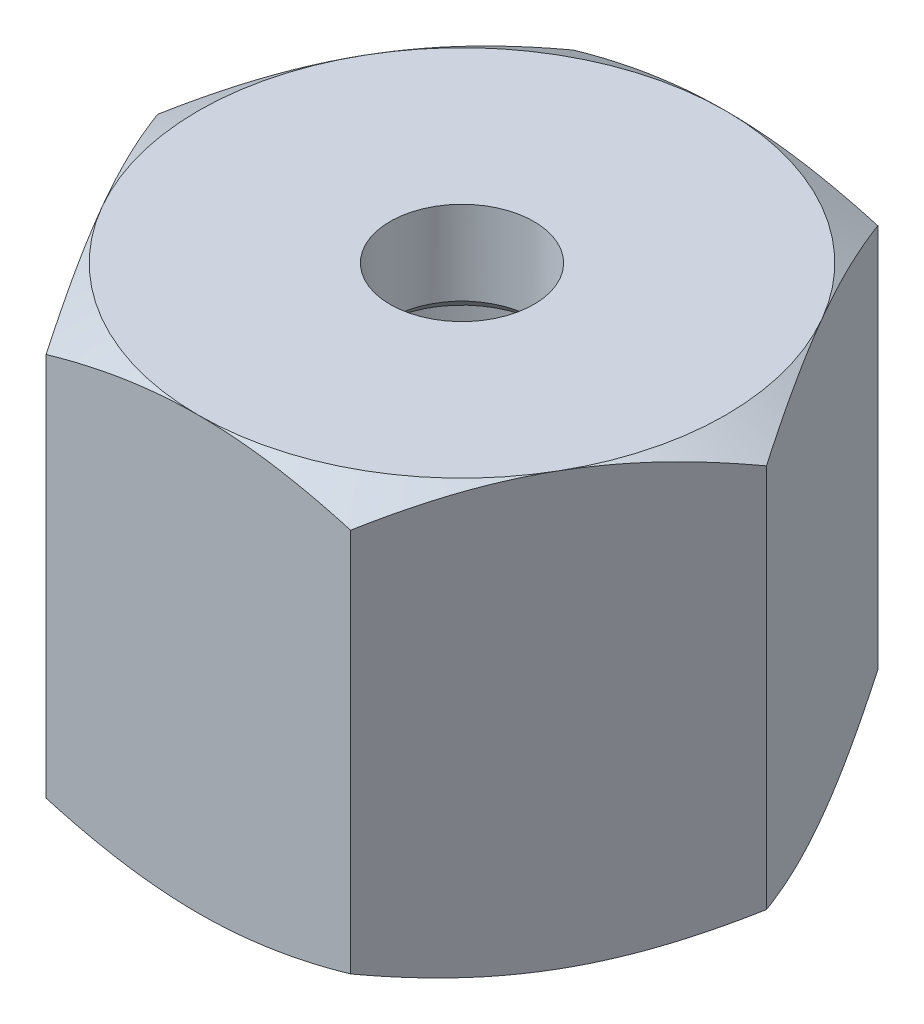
ISO-10303-21;
HEADER;
FILE_DESCRIPTION(('STEP AP214'),'2;1');
FILE_NAME('part.step','',(''),(''),'','','');
FILE_SCHEMA(('AUTOMOTIVE_DESIGN { 1 0 10303 214 1 1 1 1 }'));
ENDSEC;
DATA;
#1=APPLICATION_CONTEXT('core data for automotive mechanical design processes');
#2=APPLICATION_PROTOCOL_DEFINITION('international standard','automotive_design',2000,#1);
#3=PRODUCT_CONTEXT('',#1,'mechanical');
#4=PRODUCT('Part','Part','',(#3));
#5=PRODUCT_RELATED_PRODUCT_CATEGORY('part','',(#4));
#6=PRODUCT_DEFINITION_FORMATION('','',#4);
#7=PRODUCT_DEFINITION_CONTEXT('part definition',#1,'design');
#8=PRODUCT_DEFINITION('design','',#6,#7);
#9=PRODUCT_DEFINITION_SHAPE('','',#8);
#10=(LENGTH_UNIT() NAMED_UNIT(*) SI_UNIT(.MILLI.,.METRE.));
#11=(NAMED_UNIT(*) PLANE_ANGLE_UNIT() SI_UNIT($,.RADIAN.));
#12=(NAMED_UNIT(*) SI_UNIT($,.STERADIAN.) SOLID_ANGLE_UNIT());
#13=UNCERTAINTY_MEASURE_WITH_UNIT(LENGTH_MEASURE(1.E-05),#10,'distance_accuracy_value','');
#14=(GEOMETRIC_REPRESENTATION_CONTEXT(3) GLOBAL_UNCERTAINTY_ASSIGNED_CONTEXT((#13)) GLOBAL_UNIT_ASSIGNED_CONTEXT((#10,
#11,#12)) REPRESENTATION_CONTEXT('',''));
#15=CARTESIAN_POINT('',(0.,0.,0.));
#16=DIRECTION('',(0.,0.,1.));
#17=DIRECTION('',(1.,0.,0.));
#18=AXIS2_PLACEMENT_3D('',#15,#16,#17);
#19=CARTESIAN_POINT('',(6.35085296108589,18.,11.));
#20=DIRECTION('',(-0.866025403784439,0.,-0.5));
#21=DIRECTION('',(-0.5,0.,0.866025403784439));
#22=AXIS2_PLACEMENT_3D('',#19,#20,#21);
#23=PLANE('',#22);
#24=CARTESIAN_POINT('',(12.7018213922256,0.982547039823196,-0.000200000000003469));
#25=CARTESIAN_POINT('',(12.5622159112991,0.901959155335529,0.241603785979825));
#26=CARTESIAN_POINT('',(12.4220899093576,0.825028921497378,0.48430914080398));
#27=CARTESIAN_POINT('',(12.1407142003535,0.67949864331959,0.971666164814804));
#28=CARTESIAN_POINT('',(11.999464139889,0.610901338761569,1.21631844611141));
#29=CARTESIAN_POINT('',(11.5734380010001,0.418936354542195,1.9542173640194));
#30=CARTESIAN_POINT('',(11.2869801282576,0.309747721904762,2.45037695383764));
#31=CARTESIAN_POINT('',(10.8583090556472,0.181714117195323,3.19285703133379));
#32=CARTESIAN_POINT('',(10.7173765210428,0.145242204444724,3.43695934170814));
#33=CARTESIAN_POINT('',(10.4348589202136,0.0840813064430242,3.92629418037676));
#34=CARTESIAN_POINT('',(10.2932738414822,0.0593925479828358,4.17152673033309));
#35=CARTESIAN_POINT('',(10.0098676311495,0.0224303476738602,4.66240068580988));
#36=CARTESIAN_POINT('',(9.86804698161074,0.0101421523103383,4.90804125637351));
#37=CARTESIAN_POINT('',(9.58427426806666,-0.00175707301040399,5.39955001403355));
#38=CARTESIAN_POINT('',(9.44232220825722,-0.00136849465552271,5.64541819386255));
#39=CARTESIAN_POINT('',(9.17694200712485,0.0112011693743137,6.10507018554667));
#40=CARTESIAN_POINT('',(9.05349494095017,0.0218490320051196,6.31888677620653));
#41=CARTESIAN_POINT('',(8.80688473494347,0.0525316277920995,6.74602818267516));
#42=CARTESIAN_POINT('',(8.68372161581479,0.0725670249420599,6.9593529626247));
#43=CARTESIAN_POINT('',(8.43774623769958,0.12167538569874,7.38539481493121));
#44=CARTESIAN_POINT('',(8.31493435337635,0.150755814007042,7.59811123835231));
#45=CARTESIAN_POINT('',(8.0698863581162,0.217443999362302,8.02254681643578));
#46=CARTESIAN_POINT('',(7.94765028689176,0.255052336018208,8.23426590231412));
#47=CARTESIAN_POINT('',(7.5765957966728,0.38161991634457,8.87695113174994));
#48=CARTESIAN_POINT('',(7.32885191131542,0.483199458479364,9.30605612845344));
#49=CARTESIAN_POINT('',(6.83705838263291,0.713743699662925,10.1578675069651));
#50=CARTESIAN_POINT('',(6.59300244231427,0.842654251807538,10.580584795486));
#51=CARTESIAN_POINT('',(6.35073749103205,0.982547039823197,11.0002));
#52=B_SPLINE_CURVE_WITH_KNOTS('',3,(#24,#25,#26,#27,#28,#29,#30,#31,#32,#33,#34,#35,#36,#37,#38,
#39,#40,#41,#42,#43,#44,#45,#46,#47,#48,#49,#50,#51),.UNSPECIFIED.,.F.,.F.,(4,2,2,2,2,2,2,2,2,2,
2,2,2,4),(0.,0.871755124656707,1.74379610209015,3.49159027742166,4.34403665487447,
5.19649943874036,6.0479468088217,6.89936787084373,7.64056020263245,8.38180496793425,
9.12366309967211,9.86557166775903,11.3820155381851,12.8954827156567),.UNSPECIFIED.);
#53=CARTESIAN_POINT('',(12.7017059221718,0.982480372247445,0.));
#54=VERTEX_POINT('',#53);
#55=CARTESIAN_POINT('',(9.52627944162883,0.,5.5));
#56=VERTEX_POINT('',#55);
#57=EDGE_CURVE('E53',#54,#56,#52,.T.);
#58=ORIENTED_EDGE('',*,*,#57,.F.);
#59=DIRECTION('',(0.,-1.,0.));
#60=VECTOR('',#59,1.);
#61=CARTESIAN_POINT('',(12.7017059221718,18.,0.));
#62=LINE('',#61,#60);
#63=CARTESIAN_POINT('',(12.7017059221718,17.0175196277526,0.));
#64=VERTEX_POINT('',#63);
#65=EDGE_CURVE('E172',#64,#54,#62,.T.);
#66=ORIENTED_EDGE('',*,*,#65,.F.);
#67=CARTESIAN_POINT('',(6.35073749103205,17.0174529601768,11.0002));
#68=CARTESIAN_POINT('',(6.49034297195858,17.0980408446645,10.7583962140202));
#69=CARTESIAN_POINT('',(6.63046897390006,17.1749710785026,10.515690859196));
#70=CARTESIAN_POINT('',(6.91184468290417,17.3205013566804,10.0283338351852));
#71=CARTESIAN_POINT('',(7.05309474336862,17.3890986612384,9.78368155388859));
#72=CARTESIAN_POINT('',(7.47912088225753,17.5810636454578,9.04578263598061));
#73=CARTESIAN_POINT('',(7.76557875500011,17.6902522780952,8.54962304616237));
#74=CARTESIAN_POINT('',(8.19424982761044,17.8182858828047,7.80714296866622));
#75=CARTESIAN_POINT('',(8.33518236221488,17.8547577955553,7.56304065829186));
#76=CARTESIAN_POINT('',(8.61769996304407,17.915918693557,7.07370581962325));
#77=CARTESIAN_POINT('',(8.75928504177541,17.9406074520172,6.82847326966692));
#78=CARTESIAN_POINT('',(9.04269125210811,17.9775696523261,6.33759931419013));
#79=CARTESIAN_POINT('',(9.18451190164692,17.9898578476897,6.0919587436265));
#80=CARTESIAN_POINT('',(9.468284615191,18.0017570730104,5.60044998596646));
#81=CARTESIAN_POINT('',(9.61023667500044,18.0013684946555,5.35458180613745));
#82=CARTESIAN_POINT('',(9.87561687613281,17.9887988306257,4.89492981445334));
#83=CARTESIAN_POINT('',(9.99906394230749,17.9781509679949,4.68111322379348));
#84=CARTESIAN_POINT('',(10.2456741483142,17.9474683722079,4.25397181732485));
#85=CARTESIAN_POINT('',(10.3688372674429,17.9274329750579,4.04064703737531));
#86=CARTESIAN_POINT('',(10.6148126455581,17.8783246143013,3.6146051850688));
#87=CARTESIAN_POINT('',(10.7376245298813,17.849244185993,3.4018887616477));
#88=CARTESIAN_POINT('',(10.9826725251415,17.7825560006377,2.97745318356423));
#89=CARTESIAN_POINT('',(11.1049085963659,17.7449476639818,2.76573409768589));
#90=CARTESIAN_POINT('',(11.4759630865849,17.6183800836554,2.12304886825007));
#91=CARTESIAN_POINT('',(11.7237069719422,17.5168005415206,1.69394387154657));
#92=CARTESIAN_POINT('',(12.2155005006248,17.2862563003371,0.842132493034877));
#93=CARTESIAN_POINT('',(12.4595564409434,17.1573457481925,0.419415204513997));
#94=CARTESIAN_POINT('',(12.7018213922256,17.0174529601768,-0.000200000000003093));
#95=B_SPLINE_CURVE_WITH_KNOTS('',3,(#67,#68,#69,#70,#71,#72,#73,#74,#75,#76,#77,#78,#79,#80,#81,
#82,#83,#84,#85,#86,#87,#88,#89,#90,#91,#92,#93,#94),.UNSPECIFIED.,.F.,.F.,(4,2,2,2,2,2,2,2,2,2,
2,2,2,4),(0.,0.871755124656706,1.74379610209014,3.49159027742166,4.34403665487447,
5.19649943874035,6.0479468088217,6.89936787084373,7.64056020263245,8.38180496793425,
9.12366309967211,9.86557166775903,11.3820155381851,12.8954827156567),.UNSPECIFIED.);
#96=CARTESIAN_POINT('',(9.52627944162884,18.,5.5));
#97=VERTEX_POINT('',#96);
#98=EDGE_CURVE('E217',#97,#64,#95,.T.);
#99=ORIENTED_EDGE('',*,*,#98,.F.);
#100=CARTESIAN_POINT('',(6.35085296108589,17.0175196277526,11.));
#101=VERTEX_POINT('',#100);
#102=EDGE_CURVE('E163',#101,#97,#95,.T.);
#103=ORIENTED_EDGE('',*,*,#102,.F.);
#104=DIRECTION('',(0.,-1.,0.));
#105=VECTOR('',#104,1.);
#106=CARTESIAN_POINT('',(6.35085296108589,18.,11.));
#107=LINE('',#106,#105);
#108=CARTESIAN_POINT('',(6.35085296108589,0.982480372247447,11.));
#109=VERTEX_POINT('',#108);
#110=EDGE_CURVE('E158',#101,#109,#107,.T.);
#111=ORIENTED_EDGE('',*,*,#110,.T.);
#112=EDGE_CURVE('E150',#56,#109,#52,.T.);
#113=ORIENTED_EDGE('',*,*,#112,.F.);
#114=EDGE_LOOP('',(#58,#66,#99,#103,#111,#113));
#115=FACE_BOUND('',#114,.T.);
#116=ADVANCED_FACE('F38',(#115),#23,.F.);
#117=CARTESIAN_POINT('',(12.7017059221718,18.,0.));
#118=DIRECTION('',(-0.866025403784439,0.,0.5));
#119=DIRECTION('',(0.5,0.,0.866025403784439));
#120=AXIS2_PLACEMENT_3D('',#117,#118,#119);
#121=PLANE('',#120);
#122=CARTESIAN_POINT('',(6.35073749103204,0.982547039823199,-11.0002));
#123=CARTESIAN_POINT('',(6.49034297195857,0.901959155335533,-10.7583962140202));
#124=CARTESIAN_POINT('',(6.63046897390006,0.825028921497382,-10.515690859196));
#125=CARTESIAN_POINT('',(6.91184468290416,0.679498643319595,-10.0283338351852));
#126=CARTESIAN_POINT('',(7.05309474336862,0.610901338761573,-9.7836815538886));
#127=CARTESIAN_POINT('',(7.47912088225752,0.418936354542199,-9.04578263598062));
#128=CARTESIAN_POINT('',(7.7655787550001,0.309747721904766,-8.54962304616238));
#129=CARTESIAN_POINT('',(8.19424982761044,0.181714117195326,-7.80714296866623));
#130=CARTESIAN_POINT('',(8.33518236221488,0.145242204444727,-7.56304065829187));
#131=CARTESIAN_POINT('',(8.61769996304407,0.0840813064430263,-7.07370581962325));
#132=CARTESIAN_POINT('',(8.75928504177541,0.0593925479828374,-6.82847326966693));
#133=CARTESIAN_POINT('',(9.04269125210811,0.0224303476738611,-6.33759931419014));
#134=CARTESIAN_POINT('',(9.18451190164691,0.0101421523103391,-6.09195874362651));
#135=CARTESIAN_POINT('',(9.468284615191,-0.00175707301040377,-5.60044998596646));
#136=CARTESIAN_POINT('',(9.61023667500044,-0.00136849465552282,-5.35458180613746));
#137=CARTESIAN_POINT('',(9.87561687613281,0.0112011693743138,-4.89492981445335));
#138=CARTESIAN_POINT('',(9.99906394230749,0.0218490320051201,-4.68111322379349));
#139=CARTESIAN_POINT('',(10.2456741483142,0.0525316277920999,-4.25397181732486));
#140=CARTESIAN_POINT('',(10.3688372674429,0.0725670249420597,-4.04064703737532));
#141=CARTESIAN_POINT('',(10.6148126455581,0.121675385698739,-3.61460518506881));
#142=CARTESIAN_POINT('',(10.7376245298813,0.150755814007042,-3.40188876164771));
#143=CARTESIAN_POINT('',(10.9826725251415,0.217443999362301,-2.97745318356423));
#144=CARTESIAN_POINT('',(11.1049085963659,0.255052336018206,-2.7657340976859));
#145=CARTESIAN_POINT('',(11.4759630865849,0.381619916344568,-2.12304886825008));
#146=CARTESIAN_POINT('',(11.7237069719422,0.483199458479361,-1.69394387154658));
#147=CARTESIAN_POINT('',(12.2155005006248,0.713743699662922,-0.842132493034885));
#148=CARTESIAN_POINT('',(12.4595564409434,0.842654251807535,-0.419415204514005));
#149=CARTESIAN_POINT('',(12.7018213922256,0.982547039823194,0.000199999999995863));
#150=B_SPLINE_CURVE_WITH_KNOTS('',3,(#122,#123,#124,#125,#126,#127,#128,#129,#130,#131,#132,
#133,#134,#135,#136,#137,#138,#139,#140,#141,#142,#143,#144,#145,#146,#147,#148,#149),
.UNSPECIFIED.,.F.,.F.,(4,2,2,2,2,2,2,2,2,2,2,2,2,4),(0.,0.871755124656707,1.74379610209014,
3.49159027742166,4.34403665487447,5.19649943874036,6.0479468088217,6.89936787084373,
7.64056020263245,8.38180496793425,9.12366309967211,9.86557166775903,11.3820155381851,
12.8954827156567),.UNSPECIFIED.);
#151=CARTESIAN_POINT('',(6.35085296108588,0.982480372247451,-11.));
#152=VERTEX_POINT('',#151);
#153=CARTESIAN_POINT('',(9.52627944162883,0.,-5.5));
#154=VERTEX_POINT('',#153);
#155=EDGE_CURVE('E61',#152,#154,#150,.T.);
#156=ORIENTED_EDGE('',*,*,#155,.F.);
#157=DIRECTION('',(0.,-1.,0.));
#158=VECTOR('',#157,1.);
#159=CARTESIAN_POINT('',(6.35085296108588,18.,-11.));
#160=LINE('',#159,#158);
#161=CARTESIAN_POINT('',(6.35085296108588,17.0175196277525,-11.));
#162=VERTEX_POINT('',#161);
#163=EDGE_CURVE('E169',#162,#152,#160,.T.);
#164=ORIENTED_EDGE('',*,*,#163,.F.);
#165=CARTESIAN_POINT('',(12.7018213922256,17.0174529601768,0.000199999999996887));
#166=CARTESIAN_POINT('',(12.5622159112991,17.0980408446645,-0.241603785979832));
#167=CARTESIAN_POINT('',(12.4220899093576,17.1749710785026,-0.484309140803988));
#168=CARTESIAN_POINT('',(12.1407142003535,17.3205013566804,-0.971666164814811));
#169=CARTESIAN_POINT('',(11.999464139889,17.3890986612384,-1.21631844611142));
#170=CARTESIAN_POINT('',(11.5734380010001,17.5810636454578,-1.9542173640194));
#171=CARTESIAN_POINT('',(11.2869801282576,17.6902522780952,-2.45037695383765));
#172=CARTESIAN_POINT('',(10.8583090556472,17.8182858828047,-3.1928570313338));
#173=CARTESIAN_POINT('',(10.7173765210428,17.8547577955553,-3.43695934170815));
#174=CARTESIAN_POINT('',(10.4348589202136,17.915918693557,-3.92629418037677));
#175=CARTESIAN_POINT('',(10.2932738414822,17.9406074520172,-4.17152673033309));
#176=CARTESIAN_POINT('',(10.0098676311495,17.9775696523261,-4.66240068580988));
#177=CARTESIAN_POINT('',(9.86804698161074,17.9898578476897,-4.90804125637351));
#178=CARTESIAN_POINT('',(9.58427426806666,18.0017570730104,-5.39955001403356));
#179=CARTESIAN_POINT('',(9.44232220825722,18.0013684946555,-5.64541819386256));
#180=CARTESIAN_POINT('',(9.17694200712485,17.9887988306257,-6.10507018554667));
#181=CARTESIAN_POINT('',(9.05349494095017,17.9781509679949,-6.31888677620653));
#182=CARTESIAN_POINT('',(8.80688473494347,17.9474683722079,-6.74602818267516));
#183=CARTESIAN_POINT('',(8.68372161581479,17.9274329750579,-6.9593529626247));
#184=CARTESIAN_POINT('',(8.43774623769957,17.8783246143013,-7.38539481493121));
#185=CARTESIAN_POINT('',(8.31493435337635,17.849244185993,-7.59811123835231));
#186=CARTESIAN_POINT('',(8.0698863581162,17.7825560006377,-8.02254681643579));
#187=CARTESIAN_POINT('',(7.94765028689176,17.7449476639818,-8.23426590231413));
#188=CARTESIAN_POINT('',(7.57659579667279,17.6183800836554,-8.87695113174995));
#189=CARTESIAN_POINT('',(7.32885191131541,17.5168005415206,-9.30605612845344));
#190=CARTESIAN_POINT('',(6.8370583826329,17.2862563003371,-10.1578675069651));
#191=CARTESIAN_POINT('',(6.59300244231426,17.1573457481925,-10.580584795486));
#192=CARTESIAN_POINT('',(6.35073749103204,17.0174529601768,-11.0002));
#193=B_SPLINE_CURVE_WITH_KNOTS('',3,(#165,#166,#167,#168,#169,#170,#171,#172,#173,#174,#175,
#176,#177,#178,#179,#180,#181,#182,#183,#184,#185,#186,#187,#188,#189,#190,#191,#192),
.UNSPECIFIED.,.F.,.F.,(4,2,2,2,2,2,2,2,2,2,2,2,2,4),(0.,0.871755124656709,1.74379610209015,
3.49159027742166,4.34403665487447,5.19649943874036,6.0479468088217,6.89936787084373,
7.64056020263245,8.38180496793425,9.12366309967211,9.86557166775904,11.3820155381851,
12.8954827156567),.UNSPECIFIED.);
#194=CARTESIAN_POINT('',(9.52627944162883,18.,-5.50000000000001));
#195=VERTEX_POINT('',#194);
#196=EDGE_CURVE('E294',#195,#162,#193,.T.);
#197=ORIENTED_EDGE('',*,*,#196,.F.);
#198=EDGE_CURVE('E298',#64,#195,#193,.T.);
#199=ORIENTED_EDGE('',*,*,#198,.F.);
#200=ORIENTED_EDGE('',*,*,#65,.T.);
#201=EDGE_CURVE('E262',#154,#54,#150,.T.);
#202=ORIENTED_EDGE('',*,*,#201,.F.);
#203=EDGE_LOOP('',(#156,#164,#197,#199,#200,#202));
#204=FACE_BOUND('',#203,.T.);
#205=ADVANCED_FACE('F204',(#204),#121,.F.);
#206=CARTESIAN_POINT('',(6.35085296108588,18.,-11.));
#207=DIRECTION('',(0.,0.,1.));
#208=DIRECTION('',(1.,0.,0.));
#209=AXIS2_PLACEMENT_3D('',#206,#207,#208);
#210=PLANE('',#209);
#211=CARTESIAN_POINT('',(-16.8458280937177,5.26496849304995,-11.));
#212=CARTESIAN_POINT('',(-16.60434649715,5.14823483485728,-11.));
#213=CARTESIAN_POINT('',(-16.3625730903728,5.03210512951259,-11.));
#214=CARTESIAN_POINT('',(-15.8783810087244,4.80119224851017,-11.));
#215=CARTESIAN_POINT('',(-15.6359623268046,4.68640908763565,-11.));
#216=CARTESIAN_POINT('',(-14.9075749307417,4.34425411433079,-11.));
#217=CARTESIAN_POINT('',(-14.4205533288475,4.119114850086,-11.));
#218=CARTESIAN_POINT('',(-13.4403598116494,3.67495503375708,-11.));
#219=CARTESIAN_POINT('',(-12.9471686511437,3.4559768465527,-11.));
#220=CARTESIAN_POINT('',(-11.9567341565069,3.02741887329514,-11.));
#221=CARTESIAN_POINT('',(-11.459491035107,2.81783859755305,-11.));
#222=CARTESIAN_POINT('',(-10.4539778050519,2.40808867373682,-11.));
#223=CARTESIAN_POINT('',(-9.94564729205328,2.208066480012,-11.));
#224=CARTESIAN_POINT('',(-8.92298777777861,1.82368101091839,-11.));
#225=CARTESIAN_POINT('',(-8.40865811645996,1.63931947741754,-11.));
#226=CARTESIAN_POINT('',(-7.37425454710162,1.29120979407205,-11.));
#227=CARTESIAN_POINT('',(-6.85419550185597,1.12741784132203,-11.));
#228=CARTESIAN_POINT('',(-5.80663388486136,0.825757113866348,-11.));
#229=CARTESIAN_POINT('',(-5.27913372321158,0.687880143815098,-11.));
#230=CARTESIAN_POINT('',(-4.48220250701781,0.505547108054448,-11.));
#231=CARTESIAN_POINT('',(-4.21555592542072,0.448840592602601,-11.));
#232=CARTESIAN_POINT('',(-3.68048740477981,0.34448343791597,-11.));
#233=CARTESIAN_POINT('',(-3.41206550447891,0.296832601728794,-11.));
#234=CARTESIAN_POINT('',(-2.87362104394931,0.211430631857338,-11.));
#235=CARTESIAN_POINT('',(-2.60359835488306,0.173680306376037,-11.));
#236=CARTESIAN_POINT('',(-2.06227809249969,0.108840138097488,-11.));
#237=CARTESIAN_POINT('',(-1.7909805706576,0.0817498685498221,-11.));
#238=CARTESIAN_POINT('',(-1.24921360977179,0.0389565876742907,-11.));
#239=CARTESIAN_POINT('',(-0.978749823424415,0.0231824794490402,-11.));
#240=CARTESIAN_POINT('',(-0.43739753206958,0.00310533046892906,-11.));
#241=CARTESIAN_POINT('',(-0.166509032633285,-0.00119785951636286,-11.));
#242=CARTESIAN_POINT('',(0.375129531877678,0.00176893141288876,-11.));
#243=CARTESIAN_POINT('',(0.645879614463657,0.00903566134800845,-11.));
#244=CARTESIAN_POINT('',(1.18683741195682,0.0349616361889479,-11.));
#245=CARTESIAN_POINT('',(1.45704509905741,0.0536214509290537,-11.));
#246=CARTESIAN_POINT('',(2.11186732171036,0.112257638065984,-11.));
#247=CARTESIAN_POINT('',(2.49597946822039,0.157937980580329,-11.));
#248=CARTESIAN_POINT('',(3.2612619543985,0.269786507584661,-11.));
#249=CARTESIAN_POINT('',(3.64243146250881,0.33596028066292,-11.));
#250=CARTESIAN_POINT('',(4.40151370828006,0.48644872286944,-11.));
#251=CARTESIAN_POINT('',(4.77942301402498,0.570780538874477,-11.));
#252=CARTESIAN_POINT('',(5.53135425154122,0.755011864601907,-11.));
#253=CARTESIAN_POINT('',(5.90537654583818,0.854909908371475,-11.));
#254=CARTESIAN_POINT('',(6.65874919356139,1.0704958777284,-11.));
#255=CARTESIAN_POINT('',(7.03800528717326,1.18651093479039,-11.));
#256=CARTESIAN_POINT('',(7.7925087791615,1.430009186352,-11.));
#257=CARTESIAN_POINT('',(8.16775874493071,1.55748447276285,-11.));
#258=CARTESIAN_POINT('',(8.91274428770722,1.82126962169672,-11.));
#259=CARTESIAN_POINT('',(9.28249901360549,1.95752572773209,-11.));
#260=CARTESIAN_POINT('',(10.0191392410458,2.23803873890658,-11.));
#261=CARTESIAN_POINT('',(10.3860235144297,2.3822988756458,-11.));
#262=CARTESIAN_POINT('',(10.7515747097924,2.52976936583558,-11.));
#263=B_SPLINE_CURVE_WITH_KNOTS('',3,(#211,#212,#213,#214,#215,#216,#217,#218,#219,#220,#221,
#222,#223,#224,#225,#226,#227,#228,#229,#230,#231,#232,#233,#234,#235,#236,#237,#238,#239,#240,
#241,#242,#243,#244,#245,#246,#247,#248,#249,#250,#251,#252,#253,#254,#255,#256,#257,#258,#259,
#260,#261,#262),.UNSPECIFIED.,.F.,.F.,(4,2,2,2,2,2,2,2,2,2,2,2,2,2,2,2,2,2,2,2,2,2,2,2,2,4),(0.,
0.804648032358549,1.60930489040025,3.21888018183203,4.83766217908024,6.45635972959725,
8.09496684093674,9.73375596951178,11.368993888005,13.0037138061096,13.8214137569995,
14.6390959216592,15.4568448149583,16.274560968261,17.0870934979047,17.8996154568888,
18.7119091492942,19.5242434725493,20.6840538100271,21.8441807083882,23.0054079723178,
24.1665259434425,25.3561172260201,26.5448938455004,27.7269802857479,28.9095475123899),.UNSPECIFIED.);
#264=CARTESIAN_POINT('',(-6.35085296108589,0.982480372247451,-11.));
#265=VERTEX_POINT('',#264);
#266=CARTESIAN_POINT('',(0.,0.,-11.));
#267=VERTEX_POINT('',#266);
#268=EDGE_CURVE('E271',#265,#267,#263,.T.);
#269=ORIENTED_EDGE('',*,*,#268,.F.);
#270=DIRECTION('',(0.,-1.,0.));
#271=VECTOR('',#270,1.);
#272=CARTESIAN_POINT('',(-6.35085296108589,18.,-11.));
#273=LINE('',#272,#271);
#274=CARTESIAN_POINT('',(-6.35085296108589,17.0175196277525,-11.));
#275=VERTEX_POINT('',#274);
#276=EDGE_CURVE('E160',#275,#265,#273,.T.);
#277=ORIENTED_EDGE('',*,*,#276,.F.);
#278=CARTESIAN_POINT('',(-16.8458280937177,12.7350315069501,-11.));
#279=CARTESIAN_POINT('',(-16.60434649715,12.8517651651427,-11.));
#280=CARTESIAN_POINT('',(-16.3625730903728,12.9678948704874,-11.));
#281=CARTESIAN_POINT('',(-15.8783810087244,13.1988077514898,-11.));
#282=CARTESIAN_POINT('',(-15.6359623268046,13.3135909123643,-11.));
#283=CARTESIAN_POINT('',(-14.9075749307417,13.6557458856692,-11.));
#284=CARTESIAN_POINT('',(-14.4205533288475,13.880885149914,-11.));
#285=CARTESIAN_POINT('',(-13.4403598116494,14.3250449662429,-11.));
#286=CARTESIAN_POINT('',(-12.9471686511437,14.5440231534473,-11.));
#287=CARTESIAN_POINT('',(-11.9567341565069,14.9725811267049,-11.));
#288=CARTESIAN_POINT('',(-11.459491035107,15.182161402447,-11.));
#289=CARTESIAN_POINT('',(-10.4539778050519,15.5919113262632,-11.));
#290=CARTESIAN_POINT('',(-9.94564729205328,15.791933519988,-11.));
#291=CARTESIAN_POINT('',(-8.92298777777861,16.1763189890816,-11.));
#292=CARTESIAN_POINT('',(-8.40865811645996,16.3606805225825,-11.));
#293=CARTESIAN_POINT('',(-7.37425454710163,16.708790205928,-11.));
#294=CARTESIAN_POINT('',(-6.85419550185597,16.872582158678,-11.));
#295=CARTESIAN_POINT('',(-5.80663388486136,17.1742428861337,-11.));
#296=CARTESIAN_POINT('',(-5.27913372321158,17.3121198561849,-11.));
#297=CARTESIAN_POINT('',(-4.48220250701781,17.4944528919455,-11.));
#298=CARTESIAN_POINT('',(-4.21555592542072,17.5511594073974,-11.));
#299=CARTESIAN_POINT('',(-3.68048740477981,17.655516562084,-11.));
#300=CARTESIAN_POINT('',(-3.41206550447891,17.7031673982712,-11.));
#301=CARTESIAN_POINT('',(-2.87362104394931,17.7885693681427,-11.));
#302=CARTESIAN_POINT('',(-2.60359835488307,17.826319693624,-11.));
#303=CARTESIAN_POINT('',(-2.06227809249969,17.8911598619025,-11.));
#304=CARTESIAN_POINT('',(-1.7909805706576,17.9182501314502,-11.));
#305=CARTESIAN_POINT('',(-1.24921360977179,17.9610434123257,-11.));
#306=CARTESIAN_POINT('',(-0.978749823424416,17.976817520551,-11.));
#307=CARTESIAN_POINT('',(-0.437397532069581,17.9968946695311,-11.));
#308=CARTESIAN_POINT('',(-0.166509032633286,18.0011978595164,-11.));
#309=CARTESIAN_POINT('',(0.375129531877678,17.9982310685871,-11.));
#310=CARTESIAN_POINT('',(0.645879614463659,17.990964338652,-11.));
#311=CARTESIAN_POINT('',(1.18683741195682,17.9650383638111,-11.));
#312=CARTESIAN_POINT('',(1.45704509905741,17.9463785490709,-11.));
#313=CARTESIAN_POINT('',(2.11186732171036,17.887742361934,-11.));
#314=CARTESIAN_POINT('',(2.49597946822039,17.8420620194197,-11.));
#315=CARTESIAN_POINT('',(3.26126195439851,17.7302134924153,-11.));
#316=CARTESIAN_POINT('',(3.64243146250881,17.6640397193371,-11.));
#317=CARTESIAN_POINT('',(4.40151370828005,17.5135512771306,-11.));
#318=CARTESIAN_POINT('',(4.77942301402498,17.4292194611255,-11.));
#319=CARTESIAN_POINT('',(5.53135425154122,17.2449881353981,-11.));
#320=CARTESIAN_POINT('',(5.90537654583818,17.1450900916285,-11.));
#321=CARTESIAN_POINT('',(6.65874919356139,16.9295041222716,-11.));
#322=CARTESIAN_POINT('',(7.03800528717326,16.8134890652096,-11.));
#323=CARTESIAN_POINT('',(7.7925087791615,16.569990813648,-11.));
#324=CARTESIAN_POINT('',(8.1677587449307,16.4425155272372,-11.));
#325=CARTESIAN_POINT('',(8.91274428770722,16.1787303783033,-11.));
#326=CARTESIAN_POINT('',(9.28249901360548,16.0424742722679,-11.));
#327=CARTESIAN_POINT('',(10.0191392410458,15.7619612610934,-11.));
#328=CARTESIAN_POINT('',(10.3860235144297,15.6177011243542,-11.));
#329=CARTESIAN_POINT('',(10.7515747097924,15.4702306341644,-11.));
#330=B_SPLINE_CURVE_WITH_KNOTS('',3,(#278,#279,#280,#281,#282,#283,#284,#285,#286,#287,#288,
#289,#290,#291,#292,#293,#294,#295,#296,#297,#298,#299,#300,#301,#302,#303,#304,#305,#306,#307,
#308,#309,#310,#311,#312,#313,#314,#315,#316,#317,#318,#319,#320,#321,#322,#323,#324,#325,#326,
#327,#328,#329),.UNSPECIFIED.,.F.,.F.,(4,2,2,2,2,2,2,2,2,2,2,2,2,2,2,2,2,2,2,2,2,2,2,2,2,4),(0.,
0.804648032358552,1.60930489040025,3.21888018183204,4.83766217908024,6.45635972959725,
8.09496684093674,9.73375596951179,11.368993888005,13.0037138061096,13.8214137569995,
14.6390959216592,15.4568448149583,16.2745609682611,17.0870934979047,17.8996154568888,
18.7119091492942,19.5242434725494,20.6840538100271,21.8441807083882,23.0054079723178,
24.1665259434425,25.3561172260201,26.5448938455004,27.726980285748,28.9095475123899),.UNSPECIFIED.);
#331=CARTESIAN_POINT('',(0.,18.,-11.));
#332=VERTEX_POINT('',#331);
#333=EDGE_CURVE('E282',#332,#275,#330,.F.);
#334=ORIENTED_EDGE('',*,*,#333,.F.);
#335=EDGE_CURVE('E287',#162,#332,#330,.F.);
#336=ORIENTED_EDGE('',*,*,#335,.F.);
#337=ORIENTED_EDGE('',*,*,#163,.T.);
#338=EDGE_CURVE('E266',#267,#152,#263,.T.);
#339=ORIENTED_EDGE('',*,*,#338,.F.);
#340=EDGE_LOOP('',(#269,#277,#334,#336,#337,#339));
#341=FACE_BOUND('',#340,.T.);
#342=ADVANCED_FACE('F210',(#341),#210,.F.);
#343=CARTESIAN_POINT('',(-6.35085296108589,18.,-11.));
#344=DIRECTION('',(0.866025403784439,0.,0.5));
#345=DIRECTION('',(0.5,0.,-0.866025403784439));
#346=AXIS2_PLACEMENT_3D('',#343,#344,#345);
#347=PLANE('',#346);
#348=CARTESIAN_POINT('',(-12.7018213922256,0.982547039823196,0.000200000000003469));
#349=CARTESIAN_POINT('',(-12.5622159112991,0.90195915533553,-0.241603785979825));
#350=CARTESIAN_POINT('',(-12.4220899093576,0.825028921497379,-0.48430914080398));
#351=CARTESIAN_POINT('',(-12.1407142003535,0.679498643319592,-0.971666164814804));
#352=CARTESIAN_POINT('',(-11.999464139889,0.610901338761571,-1.21631844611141));
#353=CARTESIAN_POINT('',(-11.5734380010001,0.418936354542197,-1.9542173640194));
#354=CARTESIAN_POINT('',(-11.2869801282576,0.309747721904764,-2.45037695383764));
#355=CARTESIAN_POINT('',(-10.8583090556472,0.181714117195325,-3.19285703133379));
#356=CARTESIAN_POINT('',(-10.7173765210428,0.145242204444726,-3.43695934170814));
#357=CARTESIAN_POINT('',(-10.4348589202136,0.0840813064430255,-3.92629418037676));
#358=CARTESIAN_POINT('',(-10.2932738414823,0.0593925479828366,-4.17152673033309));
#359=CARTESIAN_POINT('',(-10.0098676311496,0.0224303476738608,-4.66240068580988));
#360=CARTESIAN_POINT('',(-9.86804698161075,0.0101421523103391,-4.90804125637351));
#361=CARTESIAN_POINT('',(-9.58427426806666,-0.00175707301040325,-5.39955001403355));
#362=CARTESIAN_POINT('',(-9.44232220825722,-0.00136849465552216,-5.64541819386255));
#363=CARTESIAN_POINT('',(-9.17694200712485,0.0112011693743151,-6.10507018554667));
#364=CARTESIAN_POINT('',(-9.05349494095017,0.0218490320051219,-6.31888677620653));
#365=CARTESIAN_POINT('',(-8.80688473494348,0.0525316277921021,-6.74602818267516));
#366=CARTESIAN_POINT('',(-8.68372161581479,0.072567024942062,-6.95935296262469));
#367=CARTESIAN_POINT('',(-8.43774623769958,0.121675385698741,-7.38539481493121));
#368=CARTESIAN_POINT('',(-8.31493435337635,0.150755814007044,-7.59811123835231));
#369=CARTESIAN_POINT('',(-8.06988635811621,0.217443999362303,-8.02254681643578));
#370=CARTESIAN_POINT('',(-7.94765028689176,0.255052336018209,-8.23426590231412));
#371=CARTESIAN_POINT('',(-7.5765957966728,0.381619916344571,-8.87695113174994));
#372=CARTESIAN_POINT('',(-7.32885191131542,0.483199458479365,-9.30605612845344));
#373=CARTESIAN_POINT('',(-6.83705838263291,0.713743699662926,-10.1578675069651));
#374=CARTESIAN_POINT('',(-6.59300244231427,0.84265425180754,-10.580584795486));
#375=CARTESIAN_POINT('',(-6.35073749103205,0.982547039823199,-11.0002));
#376=B_SPLINE_CURVE_WITH_KNOTS('',3,(#348,#349,#350,#351,#352,#353,#354,#355,#356,#357,#358,
#359,#360,#361,#362,#363,#364,#365,#366,#367,#368,#369,#370,#371,#372,#373,#374,#375),
.UNSPECIFIED.,.F.,.F.,(4,2,2,2,2,2,2,2,2,2,2,2,2,4),(0.,0.871755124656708,1.74379610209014,
3.49159027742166,4.34403665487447,5.19649943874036,6.0479468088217,6.89936787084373,
7.64056020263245,8.38180496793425,9.12366309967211,9.86557166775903,11.3820155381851,
12.8954827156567),.UNSPECIFIED.);
#377=CARTESIAN_POINT('',(-12.7017059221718,0.982480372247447,0.));
#378=VERTEX_POINT('',#377);
#379=CARTESIAN_POINT('',(-9.52627944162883,0.,-5.5));
#380=VERTEX_POINT('',#379);
#381=EDGE_CURVE('E233',#378,#380,#376,.T.);
#382=ORIENTED_EDGE('',*,*,#381,.F.);
#383=DIRECTION('',(0.,-1.,0.));
#384=VECTOR('',#383,1.);
#385=CARTESIAN_POINT('',(-12.7017059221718,18.,0.));
#386=LINE('',#385,#384);
#387=CARTESIAN_POINT('',(-12.7017059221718,17.0175196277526,0.));
#388=VERTEX_POINT('',#387);
#389=EDGE_CURVE('E157',#388,#378,#386,.T.);
#390=ORIENTED_EDGE('',*,*,#389,.F.);
#391=CARTESIAN_POINT('',(-6.35073749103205,17.0174529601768,-11.0002));
#392=CARTESIAN_POINT('',(-6.49034297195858,17.0980408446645,-10.7583962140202));
#393=CARTESIAN_POINT('',(-6.63046897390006,17.1749710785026,-10.515690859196));
#394=CARTESIAN_POINT('',(-6.91184468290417,17.3205013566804,-10.0283338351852));
#395=CARTESIAN_POINT('',(-7.05309474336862,17.3890986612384,-9.7836815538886));
#396=CARTESIAN_POINT('',(-7.47912088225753,17.5810636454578,-9.04578263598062));
#397=CARTESIAN_POINT('',(-7.76557875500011,17.6902522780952,-8.54962304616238));
#398=CARTESIAN_POINT('',(-8.19424982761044,17.8182858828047,-7.80714296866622));
#399=CARTESIAN_POINT('',(-8.33518236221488,17.8547577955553,-7.56304065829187));
#400=CARTESIAN_POINT('',(-8.61769996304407,17.915918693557,-7.07370581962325));
#401=CARTESIAN_POINT('',(-8.75928504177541,17.9406074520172,-6.82847326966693));
#402=CARTESIAN_POINT('',(-9.04269125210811,17.9775696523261,-6.33759931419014));
#403=CARTESIAN_POINT('',(-9.18451190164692,17.9898578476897,-6.09195874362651));
#404=CARTESIAN_POINT('',(-9.46828461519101,18.0017570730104,-5.60044998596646));
#405=CARTESIAN_POINT('',(-9.61023667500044,18.0013684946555,-5.35458180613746));
#406=CARTESIAN_POINT('',(-9.87561687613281,17.9887988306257,-4.89492981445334));
#407=CARTESIAN_POINT('',(-9.99906394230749,17.9781509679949,-4.68111322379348));
#408=CARTESIAN_POINT('',(-10.2456741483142,17.9474683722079,-4.25397181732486));
#409=CARTESIAN_POINT('',(-10.3688372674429,17.9274329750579,-4.04064703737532));
#410=CARTESIAN_POINT('',(-10.6148126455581,17.8783246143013,-3.6146051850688));
#411=CARTESIAN_POINT('',(-10.7376245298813,17.849244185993,-3.4018887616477));
#412=CARTESIAN_POINT('',(-10.9826725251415,17.7825560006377,-2.97745318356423));
#413=CARTESIAN_POINT('',(-11.1049085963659,17.7449476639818,-2.76573409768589));
#414=CARTESIAN_POINT('',(-11.4759630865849,17.6183800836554,-2.12304886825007));
#415=CARTESIAN_POINT('',(-11.7237069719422,17.5168005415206,-1.69394387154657));
#416=CARTESIAN_POINT('',(-12.2155005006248,17.2862563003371,-0.842132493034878));
#417=CARTESIAN_POINT('',(-12.4595564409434,17.1573457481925,-0.419415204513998));
#418=CARTESIAN_POINT('',(-12.7018213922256,17.0174529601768,0.000200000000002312));
#419=B_SPLINE_CURVE_WITH_KNOTS('',3,(#391,#392,#393,#394,#395,#396,#397,#398,#399,#400,#401,
#402,#403,#404,#405,#406,#407,#408,#409,#410,#411,#412,#413,#414,#415,#416,#417,#418),
.UNSPECIFIED.,.F.,.F.,(4,2,2,2,2,2,2,2,2,2,2,2,2,4),(0.,0.871755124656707,1.74379610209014,
3.49159027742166,4.34403665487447,5.19649943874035,6.0479468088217,6.89936787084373,
7.64056020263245,8.38180496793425,9.12366309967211,9.86557166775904,11.3820155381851,
12.8954827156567),.UNSPECIFIED.);
#420=CARTESIAN_POINT('',(-9.52627944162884,18.,-5.5));
#421=VERTEX_POINT('',#420);
#422=EDGE_CURVE('E289',#421,#388,#419,.T.);
#423=ORIENTED_EDGE('',*,*,#422,.F.);
#424=EDGE_CURVE('E288',#275,#421,#419,.T.);
#425=ORIENTED_EDGE('',*,*,#424,.F.);
#426=ORIENTED_EDGE('',*,*,#276,.T.);
#427=EDGE_CURVE('E272',#380,#265,#376,.T.);
#428=ORIENTED_EDGE('',*,*,#427,.F.);
#429=EDGE_LOOP('',(#382,#390,#423,#425,#426,#428));
#430=FACE_BOUND('',#429,.T.);
#431=ADVANCED_FACE('F277',(#430),#347,.F.);
#432=CARTESIAN_POINT('',(-12.7017059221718,18.,0.));
#433=DIRECTION('',(0.866025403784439,0.,-0.5));
#434=DIRECTION('',(-0.5,0.,-0.866025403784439));
#435=AXIS2_PLACEMENT_3D('',#432,#433,#434);
#436=PLANE('',#435);
#437=CARTESIAN_POINT('',(-6.35073749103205,0.982547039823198,11.0002));
#438=CARTESIAN_POINT('',(-6.49034297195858,0.901959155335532,10.7583962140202));
#439=CARTESIAN_POINT('',(-6.63046897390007,0.825028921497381,10.515690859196));
#440=CARTESIAN_POINT('',(-6.91184468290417,0.679498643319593,10.0283338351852));
#441=CARTESIAN_POINT('',(-7.05309474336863,0.610901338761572,9.78368155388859));
#442=CARTESIAN_POINT('',(-7.47912088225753,0.418936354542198,9.04578263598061));
#443=CARTESIAN_POINT('',(-7.76557875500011,0.309747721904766,8.54962304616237));
#444=CARTESIAN_POINT('',(-8.19424982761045,0.181714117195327,7.80714296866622));
#445=CARTESIAN_POINT('',(-8.33518236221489,0.145242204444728,7.56304065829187));
#446=CARTESIAN_POINT('',(-8.61769996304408,0.0840813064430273,7.07370581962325));
#447=CARTESIAN_POINT('',(-8.75928504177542,0.0593925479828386,6.82847326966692));
#448=CARTESIAN_POINT('',(-9.04269125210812,0.0224303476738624,6.33759931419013));
#449=CARTESIAN_POINT('',(-9.18451190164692,0.0101421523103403,6.0919587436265));
#450=CARTESIAN_POINT('',(-9.46828461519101,-0.00175707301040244,5.60044998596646));
#451=CARTESIAN_POINT('',(-9.61023667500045,-0.00136849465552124,5.35458180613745));
#452=CARTESIAN_POINT('',(-9.87561687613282,0.0112011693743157,4.89492981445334));
#453=CARTESIAN_POINT('',(-9.9990639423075,0.0218490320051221,4.68111322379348));
#454=CARTESIAN_POINT('',(-10.2456741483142,0.0525316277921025,4.25397181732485));
#455=CARTESIAN_POINT('',(-10.3688372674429,0.0725670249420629,4.04064703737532));
#456=CARTESIAN_POINT('',(-10.6148126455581,0.121675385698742,3.6146051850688));
#457=CARTESIAN_POINT('',(-10.7376245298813,0.150755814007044,3.4018887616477));
#458=CARTESIAN_POINT('',(-10.9826725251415,0.217443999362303,2.97745318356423));
#459=CARTESIAN_POINT('',(-11.1049085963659,0.255052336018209,2.76573409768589));
#460=CARTESIAN_POINT('',(-11.4759630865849,0.381619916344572,2.12304886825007));
#461=CARTESIAN_POINT('',(-11.7237069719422,0.483199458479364,1.69394387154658));
#462=CARTESIAN_POINT('',(-12.2155005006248,0.713743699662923,0.842132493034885));
#463=CARTESIAN_POINT('',(-12.4595564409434,0.842654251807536,0.419415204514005));
#464=CARTESIAN_POINT('',(-12.7018213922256,0.982547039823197,-0.000199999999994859));
#465=B_SPLINE_CURVE_WITH_KNOTS('',3,(#437,#438,#439,#440,#441,#442,#443,#444,#445,#446,#447,
#448,#449,#450,#451,#452,#453,#454,#455,#456,#457,#458,#459,#460,#461,#462,#463,#464),
.UNSPECIFIED.,.F.,.F.,(4,2,2,2,2,2,2,2,2,2,2,2,2,4),(0.,0.871755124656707,1.74379610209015,
3.49159027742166,4.34403665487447,5.19649943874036,6.0479468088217,6.89936787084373,
7.64056020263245,8.38180496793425,9.12366309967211,9.86557166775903,11.3820155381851,
12.8954827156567),.UNSPECIFIED.);
#466=CARTESIAN_POINT('',(-6.35085296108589,0.982480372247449,11.));
#467=VERTEX_POINT('',#466);
#468=CARTESIAN_POINT('',(-9.52627944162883,0.,5.5));
#469=VERTEX_POINT('',#468);
#470=EDGE_CURVE('E132',#467,#469,#465,.T.);
#471=ORIENTED_EDGE('',*,*,#470,.F.);
#472=DIRECTION('',(0.,-1.,0.));
#473=VECTOR('',#472,1.);
#474=CARTESIAN_POINT('',(-6.35085296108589,18.,11.));
#475=LINE('',#474,#473);
#476=CARTESIAN_POINT('',(-6.35085296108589,17.0175196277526,11.));
#477=VERTEX_POINT('',#476);
#478=EDGE_CURVE('E147',#477,#467,#475,.T.);
#479=ORIENTED_EDGE('',*,*,#478,.F.);
#480=CARTESIAN_POINT('',(-12.7018213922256,17.0174529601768,-0.000199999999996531));
#481=CARTESIAN_POINT('',(-12.5622159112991,17.0980408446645,0.241603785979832));
#482=CARTESIAN_POINT('',(-12.4220899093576,17.1749710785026,0.484309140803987));
#483=CARTESIAN_POINT('',(-12.1407142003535,17.3205013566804,0.971666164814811));
#484=CARTESIAN_POINT('',(-11.999464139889,17.3890986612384,1.21631844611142));
#485=CARTESIAN_POINT('',(-11.5734380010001,17.5810636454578,1.95421736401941));
#486=CARTESIAN_POINT('',(-11.2869801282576,17.6902522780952,2.45037695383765));
#487=CARTESIAN_POINT('',(-10.8583090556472,17.8182858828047,3.1928570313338));
#488=CARTESIAN_POINT('',(-10.7173765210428,17.8547577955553,3.43695934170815));
#489=CARTESIAN_POINT('',(-10.4348589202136,17.915918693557,3.92629418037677));
#490=CARTESIAN_POINT('',(-10.2932738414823,17.9406074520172,4.17152673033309));
#491=CARTESIAN_POINT('',(-10.0098676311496,17.9775696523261,4.66240068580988));
#492=CARTESIAN_POINT('',(-9.86804698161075,17.9898578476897,4.90804125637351));
#493=CARTESIAN_POINT('',(-9.58427426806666,18.0017570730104,5.39955001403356));
#494=CARTESIAN_POINT('',(-9.44232220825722,18.0013684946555,5.64541819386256));
#495=CARTESIAN_POINT('',(-9.17694200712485,17.9887988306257,6.10507018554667));
#496=CARTESIAN_POINT('',(-9.05349494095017,17.9781509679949,6.31888677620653));
#497=CARTESIAN_POINT('',(-8.80688473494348,17.9474683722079,6.74602818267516));
#498=CARTESIAN_POINT('',(-8.68372161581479,17.9274329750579,6.9593529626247));
#499=CARTESIAN_POINT('',(-8.43774623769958,17.8783246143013,7.38539481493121));
#500=CARTESIAN_POINT('',(-8.31493435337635,17.849244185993,7.59811123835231));
#501=CARTESIAN_POINT('',(-8.06988635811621,17.7825560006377,8.02254681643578));
#502=CARTESIAN_POINT('',(-7.94765028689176,17.7449476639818,8.23426590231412));
#503=CARTESIAN_POINT('',(-7.5765957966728,17.6183800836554,8.87695113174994));
#504=CARTESIAN_POINT('',(-7.32885191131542,17.5168005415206,9.30605612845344));
#505=CARTESIAN_POINT('',(-6.83705838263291,17.2862563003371,10.1578675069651));
#506=CARTESIAN_POINT('',(-6.59300244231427,17.1573457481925,10.580584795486));
#507=CARTESIAN_POINT('',(-6.35073749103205,17.0174529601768,11.0002));
#508=B_SPLINE_CURVE_WITH_KNOTS('',3,(#480,#481,#482,#483,#484,#485,#486,#487,#488,#489,#490,
#491,#492,#493,#494,#495,#496,#497,#498,#499,#500,#501,#502,#503,#504,#505,#506,#507),
.UNSPECIFIED.,.F.,.F.,(4,2,2,2,2,2,2,2,2,2,2,2,2,4),(0.,0.871755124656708,1.74379610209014,
3.49159027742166,4.34403665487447,5.19649943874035,6.0479468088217,6.89936787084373,
7.64056020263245,8.38180496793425,9.12366309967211,9.86557166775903,11.3820155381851,
12.8954827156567),.UNSPECIFIED.);
#509=CARTESIAN_POINT('',(-9.52627944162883,18.,5.5));
#510=VERTEX_POINT('',#509);
#511=EDGE_CURVE('E332',#510,#477,#508,.T.);
#512=ORIENTED_EDGE('',*,*,#511,.F.);
#513=EDGE_CURVE('E329',#388,#510,#508,.T.);
#514=ORIENTED_EDGE('',*,*,#513,.F.);
#515=ORIENTED_EDGE('',*,*,#389,.T.);
#516=EDGE_CURVE('E149',#469,#378,#465,.T.);
#517=ORIENTED_EDGE('',*,*,#516,.F.);
#518=EDGE_LOOP('',(#471,#479,#512,#514,#515,#517));
#519=FACE_BOUND('',#518,.T.);
#520=ADVANCED_FACE('F145',(#519),#436,.F.);
#521=CARTESIAN_POINT('',(-6.35085296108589,18.,11.));
#522=DIRECTION('',(0.,0.,-1.));
#523=DIRECTION('',(-1.,0.,0.));
#524=AXIS2_PLACEMENT_3D('',#521,#522,#523);
#525=PLANE('',#524);
#526=CARTESIAN_POINT('',(-16.8458280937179,5.26496849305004,11.));
#527=CARTESIAN_POINT('',(-16.6043464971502,5.14823483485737,11.));
#528=CARTESIAN_POINT('',(-16.362573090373,5.03210512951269,11.));
#529=CARTESIAN_POINT('',(-15.8783810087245,4.80119224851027,11.));
#530=CARTESIAN_POINT('',(-15.6359623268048,4.68640908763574,11.));
#531=CARTESIAN_POINT('',(-14.9075749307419,4.34425411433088,11.));
#532=CARTESIAN_POINT('',(-14.4205533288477,4.11911485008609,11.));
#533=CARTESIAN_POINT('',(-13.4403598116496,3.67495503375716,11.));
#534=CARTESIAN_POINT('',(-12.9471686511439,3.45597684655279,11.));
#535=CARTESIAN_POINT('',(-11.9567341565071,3.02741887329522,11.));
#536=CARTESIAN_POINT('',(-11.4594910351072,2.81783859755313,11.));
#537=CARTESIAN_POINT('',(-10.4539778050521,2.40808867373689,11.));
#538=CARTESIAN_POINT('',(-9.94564729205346,2.20806648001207,11.));
#539=CARTESIAN_POINT('',(-8.92298777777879,1.82368101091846,11.));
#540=CARTESIAN_POINT('',(-8.40865811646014,1.6393194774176,11.));
#541=CARTESIAN_POINT('',(-7.3742545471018,1.29120979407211,11.));
#542=CARTESIAN_POINT('',(-6.85419550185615,1.12741784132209,11.));
#543=CARTESIAN_POINT('',(-5.80663388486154,0.825757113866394,11.));
#544=CARTESIAN_POINT('',(-5.27913372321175,0.687880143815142,11.));
#545=CARTESIAN_POINT('',(-4.48220250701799,0.505547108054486,11.));
#546=CARTESIAN_POINT('',(-4.2155559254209,0.448840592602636,11.));
#547=CARTESIAN_POINT('',(-3.68048740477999,0.344483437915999,11.));
#548=CARTESIAN_POINT('',(-3.41206550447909,0.296832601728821,11.));
#549=CARTESIAN_POINT('',(-2.87362104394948,0.21143063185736,11.));
#550=CARTESIAN_POINT('',(-2.60359835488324,0.173680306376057,11.));
#551=CARTESIAN_POINT('',(-2.06227809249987,0.108840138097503,11.));
#552=CARTESIAN_POINT('',(-1.79098057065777,0.0817498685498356,11.));
#553=CARTESIAN_POINT('',(-1.24921360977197,0.0389565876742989,11.));
#554=CARTESIAN_POINT('',(-0.978749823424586,0.0231824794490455,11.));
#555=CARTESIAN_POINT('',(-0.437397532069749,0.00310533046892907,11.));
#556=CARTESIAN_POINT('',(-0.166509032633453,-0.0011978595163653,11.));
#557=CARTESIAN_POINT('',(0.375129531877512,0.00176893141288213,11.));
#558=CARTESIAN_POINT('',(0.645879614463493,0.00903566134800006,11.));
#559=CARTESIAN_POINT('',(1.18683741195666,0.0349616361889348,11.));
#560=CARTESIAN_POINT('',(1.45704509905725,0.0536214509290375,11.));
#561=CARTESIAN_POINT('',(2.11186732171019,0.11225763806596,11.));
#562=CARTESIAN_POINT('',(2.49597946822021,0.157937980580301,11.));
#563=CARTESIAN_POINT('',(3.26126195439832,0.269786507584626,11.));
#564=CARTESIAN_POINT('',(3.64243146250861,0.335960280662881,11.));
#565=CARTESIAN_POINT('',(4.40151370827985,0.486448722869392,11.));
#566=CARTESIAN_POINT('',(4.77942301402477,0.570780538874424,11.));
#567=CARTESIAN_POINT('',(5.531354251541,0.755011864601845,11.));
#568=CARTESIAN_POINT('',(5.90537654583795,0.854909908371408,11.));
#569=CARTESIAN_POINT('',(6.65874919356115,1.07049587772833,11.));
#570=CARTESIAN_POINT('',(7.03800528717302,1.18651093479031,11.));
#571=CARTESIAN_POINT('',(7.79250877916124,1.43000918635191,11.));
#572=CARTESIAN_POINT('',(8.16775874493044,1.55748447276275,11.));
#573=CARTESIAN_POINT('',(8.91274428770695,1.82126962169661,11.));
#574=CARTESIAN_POINT('',(9.28249901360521,1.95752572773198,11.));
#575=CARTESIAN_POINT('',(10.0191392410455,2.23803873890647,11.));
#576=CARTESIAN_POINT('',(10.3860235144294,2.38229887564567,11.));
#577=CARTESIAN_POINT('',(10.7515747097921,2.52976936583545,11.));
#578=B_SPLINE_CURVE_WITH_KNOTS('',3,(#526,#527,#528,#529,#530,#531,#532,#533,#534,#535,#536,
#537,#538,#539,#540,#541,#542,#543,#544,#545,#546,#547,#548,#549,#550,#551,#552,#553,#554,#555,
#556,#557,#558,#559,#560,#561,#562,#563,#564,#565,#566,#567,#568,#569,#570,#571,#572,#573,#574,
#575,#576,#577),.UNSPECIFIED.,.F.,.F.,(4,2,2,2,2,2,2,2,2,2,2,2,2,2,2,2,2,2,2,2,2,2,2,2,2,4),(0.,
0.804648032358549,1.60930489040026,3.21888018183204,4.83766217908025,6.45635972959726,
8.09496684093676,9.73375596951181,11.368993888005,13.0037138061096,13.8214137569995,
14.6390959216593,15.4568448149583,16.2745609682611,17.0870934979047,17.8996154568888,
18.7119091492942,19.5242434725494,20.6840538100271,21.8441807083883,23.0054079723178,
24.1665259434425,25.35611722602,26.5448938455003,27.7269802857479,28.9095475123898),.UNSPECIFIED.);
#579=CARTESIAN_POINT('',(0.,0.,11.));
#580=VERTEX_POINT('',#579);
#581=EDGE_CURVE('E139',#109,#580,#578,.F.);
#582=ORIENTED_EDGE('',*,*,#581,.F.);
#583=ORIENTED_EDGE('',*,*,#110,.F.);
#584=CARTESIAN_POINT('',(-16.8458280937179,12.73503150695,11.));
#585=CARTESIAN_POINT('',(-16.6043464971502,12.8517651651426,11.));
#586=CARTESIAN_POINT('',(-16.362573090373,12.9678948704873,11.));
#587=CARTESIAN_POINT('',(-15.8783810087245,13.1988077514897,11.));
#588=CARTESIAN_POINT('',(-15.6359623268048,13.3135909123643,11.));
#589=CARTESIAN_POINT('',(-14.9075749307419,13.6557458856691,11.));
#590=CARTESIAN_POINT('',(-14.4205533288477,13.8808851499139,11.));
#591=CARTESIAN_POINT('',(-13.4403598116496,14.3250449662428,11.));
#592=CARTESIAN_POINT('',(-12.9471686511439,14.5440231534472,11.));
#593=CARTESIAN_POINT('',(-11.9567341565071,14.9725811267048,11.));
#594=CARTESIAN_POINT('',(-11.4594910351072,15.1821614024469,11.));
#595=CARTESIAN_POINT('',(-10.4539778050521,15.5919113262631,11.));
#596=CARTESIAN_POINT('',(-9.94564729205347,15.7919335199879,11.));
#597=CARTESIAN_POINT('',(-8.9229877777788,16.1763189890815,11.));
#598=CARTESIAN_POINT('',(-8.40865811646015,16.3606805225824,11.));
#599=CARTESIAN_POINT('',(-7.37425454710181,16.7087902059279,11.));
#600=CARTESIAN_POINT('',(-6.85419550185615,16.8725821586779,11.));
#601=CARTESIAN_POINT('',(-5.80663388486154,17.1742428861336,11.));
#602=CARTESIAN_POINT('',(-5.27913372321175,17.3121198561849,11.));
#603=CARTESIAN_POINT('',(-4.48220250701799,17.4944528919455,11.));
#604=CARTESIAN_POINT('',(-4.21555592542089,17.5511594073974,11.));
#605=CARTESIAN_POINT('',(-3.68048740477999,17.655516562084,11.));
#606=CARTESIAN_POINT('',(-3.41206550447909,17.7031673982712,11.));
#607=CARTESIAN_POINT('',(-2.87362104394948,17.7885693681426,11.));
#608=CARTESIAN_POINT('',(-2.60359835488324,17.8263196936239,11.));
#609=CARTESIAN_POINT('',(-2.06227809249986,17.8911598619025,11.));
#610=CARTESIAN_POINT('',(-1.79098057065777,17.9182501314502,11.));
#611=CARTESIAN_POINT('',(-1.24921360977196,17.9610434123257,11.));
#612=CARTESIAN_POINT('',(-0.978749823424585,17.976817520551,11.));
#613=CARTESIAN_POINT('',(-0.43739753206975,17.9968946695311,11.));
#614=CARTESIAN_POINT('',(-0.166509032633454,18.0011978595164,11.));
#615=CARTESIAN_POINT('',(0.375129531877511,17.9982310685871,11.));
#616=CARTESIAN_POINT('',(0.645879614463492,17.990964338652,11.));
#617=CARTESIAN_POINT('',(1.18683741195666,17.9650383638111,11.));
#618=CARTESIAN_POINT('',(1.45704509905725,17.946378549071,11.));
#619=CARTESIAN_POINT('',(2.11186732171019,17.887742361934,11.));
#620=CARTESIAN_POINT('',(2.49597946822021,17.8420620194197,11.));
#621=CARTESIAN_POINT('',(3.26126195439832,17.7302134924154,11.));
#622=CARTESIAN_POINT('',(3.64243146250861,17.6640397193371,11.));
#623=CARTESIAN_POINT('',(4.40151370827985,17.5135512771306,11.));
#624=CARTESIAN_POINT('',(4.77942301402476,17.4292194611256,11.));
#625=CARTESIAN_POINT('',(5.53135425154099,17.2449881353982,11.));
#626=CARTESIAN_POINT('',(5.90537654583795,17.1450900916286,11.));
#627=CARTESIAN_POINT('',(6.65874919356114,16.9295041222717,11.));
#628=CARTESIAN_POINT('',(7.03800528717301,16.8134890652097,11.));
#629=CARTESIAN_POINT('',(7.79250877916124,16.5699908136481,11.));
#630=CARTESIAN_POINT('',(8.16775874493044,16.4425155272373,11.));
#631=CARTESIAN_POINT('',(8.91274428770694,16.1787303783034,11.));
#632=CARTESIAN_POINT('',(9.28249901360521,16.042474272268,11.));
#633=CARTESIAN_POINT('',(10.0191392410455,15.7619612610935,11.));
#634=CARTESIAN_POINT('',(10.3860235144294,15.6177011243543,11.));
#635=CARTESIAN_POINT('',(10.7515747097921,15.4702306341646,11.));
#636=B_SPLINE_CURVE_WITH_KNOTS('',3,(#584,#585,#586,#587,#588,#589,#590,#591,#592,#593,#594,
#595,#596,#597,#598,#599,#600,#601,#602,#603,#604,#605,#606,#607,#608,#609,#610,#611,#612,#613,
#614,#615,#616,#617,#618,#619,#620,#621,#622,#623,#624,#625,#626,#627,#628,#629,#630,#631,#632,
#633,#634,#635),.UNSPECIFIED.,.F.,.F.,(4,2,2,2,2,2,2,2,2,2,2,2,2,2,2,2,2,2,2,2,2,2,2,2,2,4),(0.,
0.804648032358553,1.60930489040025,3.21888018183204,4.83766217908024,6.45635972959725,
8.09496684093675,9.7337559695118,11.368993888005,13.0037138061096,13.8214137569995,
14.6390959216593,15.4568448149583,16.2745609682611,17.0870934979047,17.8996154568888,
18.7119091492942,19.5242434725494,20.6840538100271,21.8441807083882,23.0054079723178,
24.1665259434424,25.35611722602,26.5448938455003,27.7269802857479,28.9095475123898),.UNSPECIFIED.);
#637=CARTESIAN_POINT('',(0.,18.,11.));
#638=VERTEX_POINT('',#637);
#639=EDGE_CURVE('E337',#638,#101,#636,.T.);
#640=ORIENTED_EDGE('',*,*,#639,.F.);
#641=EDGE_CURVE('E156',#477,#638,#636,.T.);
#642=ORIENTED_EDGE('',*,*,#641,.F.);
#643=ORIENTED_EDGE('',*,*,#478,.T.);
#644=EDGE_CURVE('E129',#580,#467,#578,.F.);
#645=ORIENTED_EDGE('',*,*,#644,.F.);
#646=EDGE_LOOP('',(#582,#583,#640,#642,#643,#645));
#647=FACE_BOUND('',#646,.T.);
#648=ADVANCED_FACE('F153',(#647),#525,.F.);
#649=CARTESIAN_POINT('',(0.,18.,0.));
#650=DIRECTION('',(0.,-1.,0.));
#651=DIRECTION('',(0.,0.,1.));
#652=AXIS2_PLACEMENT_3D('',#649,#650,#651);
#653=CONICAL_SURFACE('',#652,11.,1.0471975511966);
#654=ORIENTED_EDGE('',*,*,#511,.T.);
#655=ORIENTED_EDGE('',*,*,#641,.T.);
#656=CARTESIAN_POINT('',(0.,18.,0.));
#657=DIRECTION('',(0.,1.,0.));
#658=DIRECTION('',(0.,0.,1.));
#659=AXIS2_PLACEMENT_3D('',#656,#657,#658);
#660=CIRCLE('',#659,11.);
#661=EDGE_CURVE('E175',#510,#638,#660,.T.);
#662=ORIENTED_EDGE('',*,*,#661,.F.);
#663=EDGE_LOOP('',(#654,#655,#662));
#664=FACE_BOUND('',#663,.T.);
#665=ADVANCED_FACE('F347',(#664),#653,.T.);
#666=ORIENTED_EDGE('',*,*,#422,.T.);
#667=ORIENTED_EDGE('',*,*,#513,.T.);
#668=EDGE_CURVE('E177',#421,#510,#660,.T.);
#669=ORIENTED_EDGE('',*,*,#668,.F.);
#670=EDGE_LOOP('',(#666,#667,#669));
#671=FACE_BOUND('',#670,.T.);
#672=ADVANCED_FACE('F401',(#671),#653,.T.);
#673=ORIENTED_EDGE('',*,*,#333,.T.);
#674=ORIENTED_EDGE('',*,*,#424,.T.);
#675=EDGE_CURVE('E312',#332,#421,#660,.T.);
#676=ORIENTED_EDGE('',*,*,#675,.F.);
#677=EDGE_LOOP('',(#673,#674,#676));
#678=FACE_BOUND('',#677,.T.);
#679=ADVANCED_FACE('F313',(#678),#653,.T.);
#680=ORIENTED_EDGE('',*,*,#196,.T.);
#681=ORIENTED_EDGE('',*,*,#335,.T.);
#682=EDGE_CURVE('E306',#195,#332,#660,.T.);
#683=ORIENTED_EDGE('',*,*,#682,.F.);
#684=EDGE_LOOP('',(#680,#681,#683));
#685=FACE_BOUND('',#684,.T.);
#686=ADVANCED_FACE('F304',(#685),#653,.T.);
#687=ORIENTED_EDGE('',*,*,#98,.T.);
#688=ORIENTED_EDGE('',*,*,#198,.T.);
#689=EDGE_CURVE('E178',#97,#195,#660,.T.);
#690=ORIENTED_EDGE('',*,*,#689,.F.);
#691=EDGE_LOOP('',(#687,#688,#690));
#692=FACE_BOUND('',#691,.T.);
#693=ADVANCED_FACE('F359',(#692),#653,.T.);
#694=ORIENTED_EDGE('',*,*,#102,.T.);
#695=CARTESIAN_POINT('',(0.,18.,0.));
#696=DIRECTION('',(0.,1.,0.));
#697=DIRECTION('',(0.,0.,1.));
#698=AXIS2_PLACEMENT_3D('',#695,#696,#697);
#699=CIRCLE('',#698,11.);
#700=EDGE_CURVE('E273',#638,#97,#699,.T.);
#701=ORIENTED_EDGE('',*,*,#700,.F.);
#702=ORIENTED_EDGE('',*,*,#639,.T.);
#703=EDGE_LOOP('',(#694,#701,#702));
#704=FACE_BOUND('',#703,.T.);
#705=ADVANCED_FACE('F248',(#704),#653,.T.);
#706=CARTESIAN_POINT('',(12.7017059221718,18.,0.));
#707=DIRECTION('',(0.,1.,0.));
#708=DIRECTION('',(0.,0.,1.));
#709=AXIS2_PLACEMENT_3D('',#706,#707,#708);
#710=PLANE('',#709);
#711=CARTESIAN_POINT('',(0.,18.,0.));
#712=DIRECTION('',(0.,1.,0.));
#713=DIRECTION('',(0.,0.,1.));
#714=AXIS2_PLACEMENT_3D('',#711,#712,#713);
#715=CIRCLE('',#714,3.);
#716=CARTESIAN_POINT('',(0.,18.,3.));
#717=VERTEX_POINT('',#716);
#718=EDGE_CURVE('E363',#717,#717,#715,.T.);
#719=ORIENTED_EDGE('',*,*,#718,.F.);
#720=EDGE_LOOP('',(#719));
#721=FACE_BOUND('',#720,.T.);
#722=ORIENTED_EDGE('',*,*,#661,.T.);
#723=ORIENTED_EDGE('',*,*,#700,.T.);
#724=ORIENTED_EDGE('',*,*,#689,.T.);
#725=ORIENTED_EDGE('',*,*,#682,.T.);
#726=ORIENTED_EDGE('',*,*,#675,.T.);
#727=ORIENTED_EDGE('',*,*,#668,.T.);
#728=EDGE_LOOP('',(#722,#723,#724,#725,#726,#727));
#729=FACE_BOUND('',#728,.T.);
#730=ADVANCED_FACE('F319',(#721,#729),#710,.T.);
#731=CARTESIAN_POINT('',(0.,0.,0.));
#732=DIRECTION('',(0.,1.,0.));
#733=DIRECTION('',(0.,0.,-1.));
#734=AXIS2_PLACEMENT_3D('',#731,#732,#733);
#735=CONICAL_SURFACE('',#734,11.,1.0471975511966);
#736=ORIENTED_EDGE('',*,*,#470,.T.);
#737=CARTESIAN_POINT('',(0.,0.,0.));
#738=DIRECTION('',(0.,1.,0.));
#739=DIRECTION('',(0.,0.,1.));
#740=AXIS2_PLACEMENT_3D('',#737,#738,#739);
#741=CIRCLE('',#740,11.);
#742=EDGE_CURVE('E134',#469,#580,#741,.T.);
#743=ORIENTED_EDGE('',*,*,#742,.T.);
#744=ORIENTED_EDGE('',*,*,#644,.T.);
#745=EDGE_LOOP('',(#736,#743,#744));
#746=FACE_BOUND('',#745,.T.);
#747=ADVANCED_FACE('F131',(#746),#735,.T.);
#748=ORIENTED_EDGE('',*,*,#381,.T.);
#749=EDGE_CURVE('E180',#380,#469,#741,.T.);
#750=ORIENTED_EDGE('',*,*,#749,.T.);
#751=ORIENTED_EDGE('',*,*,#516,.T.);
#752=EDGE_LOOP('',(#748,#750,#751));
#753=FACE_BOUND('',#752,.T.);
#754=ADVANCED_FACE('F244',(#753),#735,.T.);
#755=ORIENTED_EDGE('',*,*,#268,.T.);
#756=EDGE_CURVE('E378',#267,#380,#741,.T.);
#757=ORIENTED_EDGE('',*,*,#756,.T.);
#758=ORIENTED_EDGE('',*,*,#427,.T.);
#759=EDGE_LOOP('',(#755,#757,#758));
#760=FACE_BOUND('',#759,.T.);
#761=ADVANCED_FACE('F239',(#760),#735,.T.);
#762=ORIENTED_EDGE('',*,*,#338,.T.);
#763=ORIENTED_EDGE('',*,*,#155,.T.);
#764=CARTESIAN_POINT('',(0.,0.,0.));
#765=DIRECTION('',(0.,-1.,0.));
#766=DIRECTION('',(0.,0.,-1.));
#767=AXIS2_PLACEMENT_3D('',#764,#765,#766);
#768=CIRCLE('',#767,11.);
#769=EDGE_CURVE('E140',#267,#154,#768,.T.);
#770=ORIENTED_EDGE('',*,*,#769,.F.);
#771=EDGE_LOOP('',(#762,#763,#770));
#772=FACE_BOUND('',#771,.T.);
#773=ADVANCED_FACE('F243',(#772),#735,.T.);
#774=ORIENTED_EDGE('',*,*,#201,.T.);
#775=ORIENTED_EDGE('',*,*,#57,.T.);
#776=EDGE_CURVE('E374',#56,#154,#741,.T.);
#777=ORIENTED_EDGE('',*,*,#776,.T.);
#778=EDGE_LOOP('',(#774,#775,#777));
#779=FACE_BOUND('',#778,.T.);
#780=ADVANCED_FACE('F381',(#779),#735,.T.);
#781=ORIENTED_EDGE('',*,*,#112,.T.);
#782=ORIENTED_EDGE('',*,*,#581,.T.);
#783=EDGE_CURVE('E181',#580,#56,#741,.T.);
#784=ORIENTED_EDGE('',*,*,#783,.T.);
#785=EDGE_LOOP('',(#781,#782,#784));
#786=FACE_BOUND('',#785,.T.);
#787=ADVANCED_FACE('F351',(#786),#735,.T.);
#788=CARTESIAN_POINT('',(12.7017059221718,0.,0.));
#789=DIRECTION('',(0.,1.,0.));
#790=DIRECTION('',(0.,0.,1.));
#791=AXIS2_PLACEMENT_3D('',#788,#789,#790);
#792=PLANE('',#791);
#793=CARTESIAN_POINT('',(0.,0.,0.));
#794=DIRECTION('',(0.,1.,0.));
#795=DIRECTION('',(0.,0.,1.));
#796=AXIS2_PLACEMENT_3D('',#793,#794,#795);
#797=CIRCLE('',#796,8.10000000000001);
#798=CARTESIAN_POINT('',(0.,0.,8.10000000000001));
#799=VERTEX_POINT('',#798);
#800=EDGE_CURVE('E185',#799,#799,#797,.T.);
#801=ORIENTED_EDGE('',*,*,#800,.T.);
#802=EDGE_LOOP('',(#801));
#803=FACE_BOUND('',#802,.T.);
#804=ORIENTED_EDGE('',*,*,#783,.F.);
#805=ORIENTED_EDGE('',*,*,#742,.F.);
#806=ORIENTED_EDGE('',*,*,#749,.F.);
#807=ORIENTED_EDGE('',*,*,#756,.F.);
#808=ORIENTED_EDGE('',*,*,#769,.T.);
#809=ORIENTED_EDGE('',*,*,#776,.F.);
#810=EDGE_LOOP('',(#804,#805,#806,#807,#808,#809));
#811=FACE_BOUND('',#810,.T.);
#812=ADVANCED_FACE('F348',(#803,#811),#792,.F.);
#813=CARTESIAN_POINT('',(0.,14.,0.));
#814=DIRECTION('',(0.,-1.,0.));
#815=DIRECTION('',(0.,0.,-1.));
#816=AXIS2_PLACEMENT_3D('',#813,#814,#815);
#817=CYLINDRICAL_SURFACE('',#816,7.75);
#818=CARTESIAN_POINT('',(0.,0.350000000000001,0.));
#819=DIRECTION('',(0.,1.,0.));
#820=DIRECTION('',(0.,0.,1.));
#821=AXIS2_PLACEMENT_3D('',#818,#819,#820);
#822=CIRCLE('',#821,7.75);
#823=CARTESIAN_POINT('',(0.,0.350000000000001,7.75));
#824=VERTEX_POINT('',#823);
#825=EDGE_CURVE('E182',#824,#824,#822,.F.);
#826=ORIENTED_EDGE('',*,*,#825,.T.);
#827=EDGE_LOOP('',(#826));
#828=FACE_BOUND('',#827,.T.);
#829=CARTESIAN_POINT('',(0.,14.,0.));
#830=DIRECTION('',(0.,-1.,0.));
#831=DIRECTION('',(0.,0.,-1.));
#832=AXIS2_PLACEMENT_3D('',#829,#830,#831);
#833=CIRCLE('',#832,7.75);
#834=CARTESIAN_POINT('',(0.,14.,-7.75));
#835=VERTEX_POINT('',#834);
#836=EDGE_CURVE('E365',#835,#835,#833,.T.);
#837=ORIENTED_EDGE('',*,*,#836,.F.);
#838=EDGE_LOOP('',(#837));
#839=FACE_BOUND('',#838,.T.);
#840=ADVANCED_FACE('F246',(#828,#839),#817,.F.);
#841=CARTESIAN_POINT('',(0.,14.,0.));
#842=DIRECTION('',(0.,-1.,0.));
#843=DIRECTION('',(0.,0.,-1.));
#844=AXIS2_PLACEMENT_3D('',#841,#842,#843);
#845=PLANE('',#844);
#846=CARTESIAN_POINT('',(0.,14.,0.));
#847=DIRECTION('',(0.,-1.,0.));
#848=DIRECTION('',(0.,0.,-1.));
#849=AXIS2_PLACEMENT_3D('',#846,#847,#848);
#850=CIRCLE('',#849,3.5);
#851=CARTESIAN_POINT('',(0.,14.,-3.5));
#852=VERTEX_POINT('',#851);
#853=EDGE_CURVE('E46',#852,#852,#850,.F.);
#854=ORIENTED_EDGE('',*,*,#853,.T.);
#855=EDGE_LOOP('',(#854));
#856=FACE_BOUND('',#855,.T.);
#857=ORIENTED_EDGE('',*,*,#836,.T.);
#858=EDGE_LOOP('',(#857));
#859=FACE_BOUND('',#858,.T.);
#860=ADVANCED_FACE('F190',(#856,#859),#845,.T.);
#861=CARTESIAN_POINT('',(0.,0.350000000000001,0.));
#862=DIRECTION('',(0.,-1.,0.));
#863=DIRECTION('',(0.,0.,-1.));
#864=AXIS2_PLACEMENT_3D('',#861,#862,#863);
#865=CONICAL_SURFACE('',#864,7.75,0.785398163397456);
#866=ORIENTED_EDGE('',*,*,#800,.F.);
#867=EDGE_LOOP('',(#866));
#868=FACE_BOUND('',#867,.T.);
#869=ORIENTED_EDGE('',*,*,#825,.F.);
#870=EDGE_LOOP('',(#869));
#871=FACE_BOUND('',#870,.T.);
#872=ADVANCED_FACE('F199',(#868,#871),#865,.F.);
#873=CARTESIAN_POINT('',(0.,-0.001000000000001,0.));
#874=DIRECTION('',(0.,1.,0.));
#875=DIRECTION('',(0.,0.,1.));
#876=AXIS2_PLACEMENT_3D('',#873,#874,#875);
#877=CYLINDRICAL_SURFACE('',#876,3.);
#878=CARTESIAN_POINT('',(0.,14.5,0.));
#879=DIRECTION('',(0.,-1.,0.));
#880=DIRECTION('',(0.,0.,-1.));
#881=AXIS2_PLACEMENT_3D('',#878,#879,#880);
#882=CIRCLE('',#881,3.);
#883=CARTESIAN_POINT('',(0.,14.5,-3.));
#884=VERTEX_POINT('',#883);
#885=EDGE_CURVE('E12',#884,#884,#882,.T.);
#886=ORIENTED_EDGE('',*,*,#885,.T.);
#887=EDGE_LOOP('',(#886));
#888=FACE_BOUND('',#887,.T.);
#889=ORIENTED_EDGE('',*,*,#718,.T.);
#890=EDGE_LOOP('',(#889));
#891=FACE_BOUND('',#890,.T.);
#892=ADVANCED_FACE('F194',(#888,#891),#877,.F.);
#893=CARTESIAN_POINT('',(0.,14.,0.));
#894=DIRECTION('',(0.,-1.,0.));
#895=DIRECTION('',(0.,0.,-1.));
#896=AXIS2_PLACEMENT_3D('',#893,#894,#895);
#897=CONICAL_SURFACE('',#896,3.5,0.785398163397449);
#898=ORIENTED_EDGE('',*,*,#885,.F.);
#899=EDGE_LOOP('',(#898));
#900=FACE_BOUND('',#899,.T.);
#901=ORIENTED_EDGE('',*,*,#853,.F.);
#902=EDGE_LOOP('',(#901));
#903=FACE_BOUND('',#902,.T.);
#904=ADVANCED_FACE('F40',(#900,#903),#897,.F.);
#905=CLOSED_SHELL('',(#116,#205,#342,#431,#520,#648,#665,#672,#679,#686,#693,#705,#730,#747,
#754,#761,#773,#780,#787,#812,#840,#860,#872,#892,#904));
#906=MANIFOLD_SOLID_BREP('B2',#905);
#907=ADVANCED_BREP_SHAPE_REPRESENTATION('',(#18,#906),#14);
#908=SHAPE_DEFINITION_REPRESENTATION(#9,#907);
ENDSEC;
END-ISO-10303-21;
